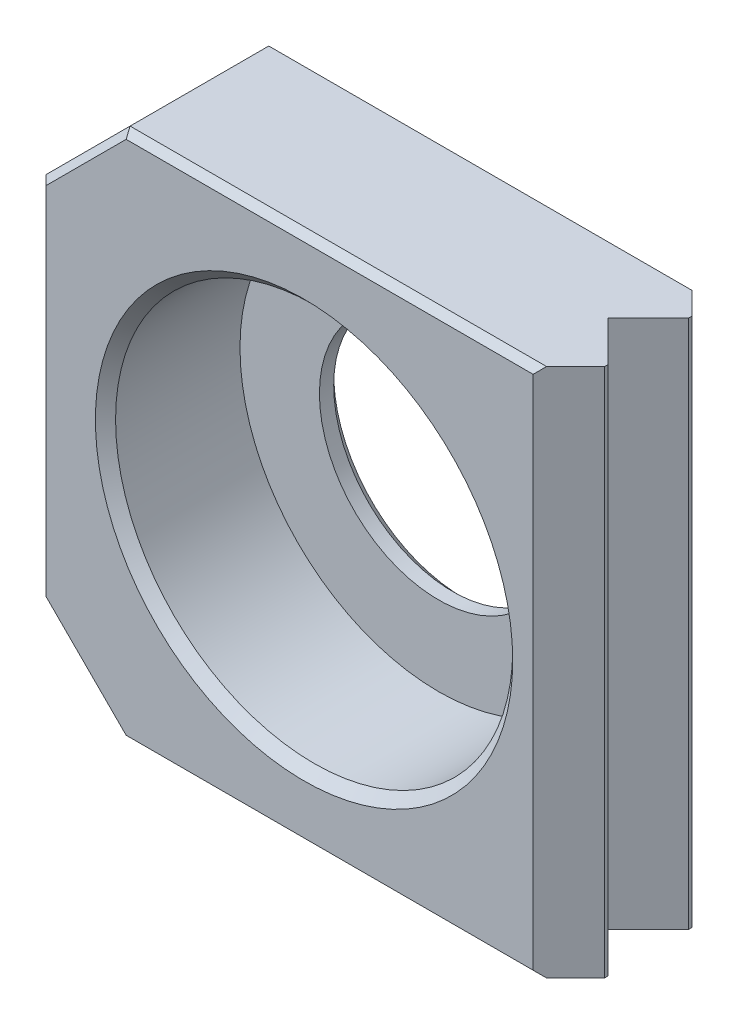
ISO-10303-21;
HEADER;
FILE_DESCRIPTION(('STEP AP214'),'2;1');
FILE_NAME('part.step','',(''),(''),'','','');
FILE_SCHEMA(('AUTOMOTIVE_DESIGN { 1 0 10303 214 1 1 1 1 }'));
ENDSEC;
DATA;
#1=APPLICATION_CONTEXT('core data for automotive mechanical design processes');
#2=APPLICATION_PROTOCOL_DEFINITION('international standard','automotive_design',2000,#1);
#3=PRODUCT_CONTEXT('',#1,'mechanical');
#4=PRODUCT('Part','Part','',(#3));
#5=PRODUCT_RELATED_PRODUCT_CATEGORY('part','',(#4));
#6=PRODUCT_DEFINITION_FORMATION('','',#4);
#7=PRODUCT_DEFINITION_CONTEXT('part definition',#1,'design');
#8=PRODUCT_DEFINITION('design','',#6,#7);
#9=PRODUCT_DEFINITION_SHAPE('','',#8);
#10=(LENGTH_UNIT() NAMED_UNIT(*) SI_UNIT(.MILLI.,.METRE.));
#11=(NAMED_UNIT(*) PLANE_ANGLE_UNIT() SI_UNIT($,.RADIAN.));
#12=(NAMED_UNIT(*) SI_UNIT($,.STERADIAN.) SOLID_ANGLE_UNIT());
#13=UNCERTAINTY_MEASURE_WITH_UNIT(LENGTH_MEASURE(1.E-05),#10,'distance_accuracy_value','');
#14=(GEOMETRIC_REPRESENTATION_CONTEXT(3) GLOBAL_UNCERTAINTY_ASSIGNED_CONTEXT((#13)) GLOBAL_UNIT_ASSIGNED_CONTEXT((#10,
#11,#12)) REPRESENTATION_CONTEXT('',''));
#15=CARTESIAN_POINT('',(0.,0.,0.));
#16=DIRECTION('',(0.,0.,1.));
#17=DIRECTION('',(1.,0.,0.));
#18=AXIS2_PLACEMENT_3D('',#15,#16,#17);
#19=CARTESIAN_POINT('',(10.,-10.,6.));
#20=DIRECTION('',(-1.,0.,0.));
#21=DIRECTION('',(0.,-1.,0.));
#22=AXIS2_PLACEMENT_3D('',#19,#20,#21);
#23=PLANE('',#22);
#24=DIRECTION('',(0.,-1.,0.));
#25=VECTOR('',#24,1.);
#26=CARTESIAN_POINT('',(10.,-10.,4.524));
#27=LINE('',#26,#25);
#28=CARTESIAN_POINT('',(10.,10.,4.524));
#29=VERTEX_POINT('',#28);
#30=CARTESIAN_POINT('',(10.,-10.,4.524));
#31=VERTEX_POINT('',#30);
#32=EDGE_CURVE('E176',#29,#31,#27,.T.);
#33=ORIENTED_EDGE('',*,*,#32,.F.);
#34=DIRECTION('',(0.,0.,-1.));
#35=VECTOR('',#34,1.);
#36=CARTESIAN_POINT('',(10.,10.,6.));
#37=LINE('',#36,#35);
#38=CARTESIAN_POINT('',(10.,10.,4.651));
#39=VERTEX_POINT('',#38);
#40=EDGE_CURVE('E159',#39,#29,#37,.T.);
#41=ORIENTED_EDGE('',*,*,#40,.F.);
#42=DIRECTION('',(0.,1.,0.));
#43=VECTOR('',#42,1.);
#44=CARTESIAN_POINT('',(10.,-10.,4.651));
#45=LINE('',#44,#43);
#46=CARTESIAN_POINT('',(10.,-10.,4.651));
#47=VERTEX_POINT('',#46);
#48=EDGE_CURVE('E173',#47,#39,#45,.T.);
#49=ORIENTED_EDGE('',*,*,#48,.F.);
#50=DIRECTION('',(0.,0.,-1.));
#51=VECTOR('',#50,1.);
#52=CARTESIAN_POINT('',(10.,-10.,6.));
#53=LINE('',#52,#51);
#54=EDGE_CURVE('E187',#47,#31,#53,.T.);
#55=ORIENTED_EDGE('',*,*,#54,.T.);
#56=EDGE_LOOP('',(#33,#41,#49,#55));
#57=FACE_BOUND('',#56,.T.);
#58=ADVANCED_FACE('F15',(#57),#23,.F.);
#59=CARTESIAN_POINT('',(-10.,10.,6.));
#60=DIRECTION('',(0.,1.,0.));
#61=DIRECTION('',(-1.,0.,0.));
#62=AXIS2_PLACEMENT_3D('',#59,#60,#61);
#63=PLANE('',#62);
#64=DIRECTION('',(0.,0.,1.));
#65=VECTOR('',#64,1.);
#66=CARTESIAN_POINT('',(-6.825,10.,6.));
#67=LINE('',#66,#65);
#68=CARTESIAN_POINT('',(-6.825,10.,0.508));
#69=VERTEX_POINT('',#68);
#70=CARTESIAN_POINT('',(-6.825,10.,5.746));
#71=VERTEX_POINT('',#70);
#72=EDGE_CURVE('E202',#69,#71,#67,.T.);
#73=ORIENTED_EDGE('',*,*,#72,.T.);
#74=DIRECTION('',(1.,0.,0.));
#75=VECTOR('',#74,1.);
#76=CARTESIAN_POINT('',(8.651,10.,5.746));
#77=LINE('',#76,#75);
#78=CARTESIAN_POINT('',(8.905,10.,5.746));
#79=VERTEX_POINT('',#78);
#80=EDGE_CURVE('E9',#71,#79,#77,.T.);
#81=ORIENTED_EDGE('',*,*,#80,.T.);
#82=DIRECTION('',(-0.707106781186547,0.,0.707106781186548));
#83=VECTOR('',#82,1.);
#84=CARTESIAN_POINT('',(10.0635,10.,4.5875));
#85=LINE('',#84,#83);
#86=EDGE_CURVE('E160',#39,#79,#85,.T.);
#87=ORIENTED_EDGE('',*,*,#86,.F.);
#88=ORIENTED_EDGE('',*,*,#40,.T.);
#89=DIRECTION('',(0.707106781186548,0.,0.707106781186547));
#90=VECTOR('',#89,1.);
#91=CARTESIAN_POINT('',(8.476,10.,3.));
#92=LINE('',#91,#90);
#93=CARTESIAN_POINT('',(8.476,10.,3.));
#94=VERTEX_POINT('',#93);
#95=EDGE_CURVE('E137',#94,#29,#92,.T.);
#96=ORIENTED_EDGE('',*,*,#95,.F.);
#97=DIRECTION('',(0.707106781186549,0.,-0.707106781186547));
#98=VECTOR('',#97,1.);
#99=CARTESIAN_POINT('',(8.476,10.,3.));
#100=LINE('',#99,#98);
#101=CARTESIAN_POINT('',(10.,10.,1.476));
#102=VERTEX_POINT('',#101);
#103=EDGE_CURVE('E144',#94,#102,#100,.T.);
#104=ORIENTED_EDGE('',*,*,#103,.T.);
#105=CARTESIAN_POINT('',(10.,10.,1.349));
#106=VERTEX_POINT('',#105);
#107=EDGE_CURVE('E188',#102,#106,#37,.T.);
#108=ORIENTED_EDGE('',*,*,#107,.T.);
#109=DIRECTION('',(-0.707106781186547,0.,-0.707106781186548));
#110=VECTOR('',#109,1.);
#111=CARTESIAN_POINT('',(10.0635,10.,1.4125));
#112=LINE('',#111,#110);
#113=CARTESIAN_POINT('',(9.159,10.,0.508));
#114=VERTEX_POINT('',#113);
#115=EDGE_CURVE('E153',#106,#114,#112,.T.);
#116=ORIENTED_EDGE('',*,*,#115,.T.);
#117=DIRECTION('',(-1.,0.,0.));
#118=VECTOR('',#117,1.);
#119=CARTESIAN_POINT('',(-10.,10.,0.508));
#120=LINE('',#119,#118);
#121=EDGE_CURVE('E241',#114,#69,#120,.T.);
#122=ORIENTED_EDGE('',*,*,#121,.T.);
#123=EDGE_LOOP('',(#73,#81,#87,#88,#96,#104,#108,#116,#122));
#124=FACE_BOUND('',#123,.T.);
#125=ADVANCED_FACE('F156',(#124),#63,.T.);
#126=CARTESIAN_POINT('',(10.,-10.,6.));
#127=DIRECTION('',(0.,-1.,0.));
#128=DIRECTION('',(1.,0.,0.));
#129=AXIS2_PLACEMENT_3D('',#126,#127,#128);
#130=PLANE('',#129);
#131=DIRECTION('',(-0.707106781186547,0.,0.707106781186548));
#132=VECTOR('',#131,1.);
#133=CARTESIAN_POINT('',(10.0635,-10.,4.5875));
#134=LINE('',#133,#132);
#135=CARTESIAN_POINT('',(8.905,-10.,5.746));
#136=VERTEX_POINT('',#135);
#137=EDGE_CURVE('E303',#47,#136,#134,.T.);
#138=ORIENTED_EDGE('',*,*,#137,.T.);
#139=DIRECTION('',(-1.,0.,0.));
#140=VECTOR('',#139,1.);
#141=CARTESIAN_POINT('',(-6.825,-10.,5.746));
#142=LINE('',#141,#140);
#143=CARTESIAN_POINT('',(-6.825,-10.,5.746));
#144=VERTEX_POINT('',#143);
#145=EDGE_CURVE('E243',#136,#144,#142,.T.);
#146=ORIENTED_EDGE('',*,*,#145,.T.);
#147=DIRECTION('',(0.,0.,-1.));
#148=VECTOR('',#147,1.);
#149=CARTESIAN_POINT('',(-6.825,-10.,0.));
#150=LINE('',#149,#148);
#151=CARTESIAN_POINT('',(-6.825,-10.,0.508));
#152=VERTEX_POINT('',#151);
#153=EDGE_CURVE('E196',#144,#152,#150,.T.);
#154=ORIENTED_EDGE('',*,*,#153,.T.);
#155=DIRECTION('',(1.,0.,0.));
#156=VECTOR('',#155,1.);
#157=CARTESIAN_POINT('',(10.,-10.,0.508));
#158=LINE('',#157,#156);
#159=CARTESIAN_POINT('',(9.159,-10.,0.508));
#160=VERTEX_POINT('',#159);
#161=EDGE_CURVE('E227',#152,#160,#158,.T.);
#162=ORIENTED_EDGE('',*,*,#161,.T.);
#163=DIRECTION('',(-0.707106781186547,0.,-0.707106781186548));
#164=VECTOR('',#163,1.);
#165=CARTESIAN_POINT('',(10.0635,-10.,1.4125));
#166=LINE('',#165,#164);
#167=CARTESIAN_POINT('',(10.,-10.,1.349));
#168=VERTEX_POINT('',#167);
#169=EDGE_CURVE('E165',#168,#160,#166,.T.);
#170=ORIENTED_EDGE('',*,*,#169,.F.);
#171=CARTESIAN_POINT('',(10.,-10.,1.476));
#172=VERTEX_POINT('',#171);
#173=EDGE_CURVE('E184',#172,#168,#53,.T.);
#174=ORIENTED_EDGE('',*,*,#173,.F.);
#175=DIRECTION('',(0.707106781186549,0.,-0.707106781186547));
#176=VECTOR('',#175,1.);
#177=CARTESIAN_POINT('',(8.476,-10.,3.));
#178=LINE('',#177,#176);
#179=CARTESIAN_POINT('',(8.476,-10.,3.));
#180=VERTEX_POINT('',#179);
#181=EDGE_CURVE('E161',#180,#172,#178,.T.);
#182=ORIENTED_EDGE('',*,*,#181,.F.);
#183=DIRECTION('',(0.707106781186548,0.,0.707106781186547));
#184=VECTOR('',#183,1.);
#185=CARTESIAN_POINT('',(8.476,-10.,3.));
#186=LINE('',#185,#184);
#187=EDGE_CURVE('E140',#180,#31,#186,.T.);
#188=ORIENTED_EDGE('',*,*,#187,.T.);
#189=ORIENTED_EDGE('',*,*,#54,.F.);
#190=EDGE_LOOP('',(#138,#146,#154,#162,#170,#174,#182,#188,#189));
#191=FACE_BOUND('',#190,.T.);
#192=ADVANCED_FACE('F355',(#191),#130,.T.);
#193=CARTESIAN_POINT('',(10.,10.,6.));
#194=DIRECTION('',(0.,0.,-1.));
#195=DIRECTION('',(1.,0.,0.));
#196=AXIS2_PLACEMENT_3D('',#193,#194,#195);
#197=PLANE('',#196);
#198=CARTESIAN_POINT('',(0.,0.,6.));
#199=DIRECTION('',(0.,0.,-1.));
#200=DIRECTION('',(1.,0.,0.));
#201=AXIS2_PLACEMENT_3D('',#198,#199,#200);
#202=CIRCLE('',#201,7.881);
#203=CARTESIAN_POINT('',(7.881,0.,6.));
#204=VERTEX_POINT('',#203);
#205=EDGE_CURVE('E207',#204,#204,#202,.T.);
#206=ORIENTED_EDGE('',*,*,#205,.T.);
#207=EDGE_LOOP('',(#206));
#208=FACE_BOUND('',#207,.T.);
#209=DIRECTION('',(0.707106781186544,-0.707106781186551,0.));
#210=VECTOR('',#209,1.);
#211=CARTESIAN_POINT('',(-6.64539487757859,-9.82039487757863,6.));
#212=LINE('',#211,#210);
#213=CARTESIAN_POINT('',(-9.746,-6.71978975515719,6.));
#214=VERTEX_POINT('',#213);
#215=CARTESIAN_POINT('',(-6.71978975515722,-9.746,6.));
#216=VERTEX_POINT('',#215);
#217=EDGE_CURVE('E252',#214,#216,#212,.T.);
#218=ORIENTED_EDGE('',*,*,#217,.T.);
#219=DIRECTION('',(1.,0.,0.));
#220=VECTOR('',#219,1.);
#221=CARTESIAN_POINT('',(8.651,-9.746,6.));
#222=LINE('',#221,#220);
#223=CARTESIAN_POINT('',(8.651,-9.746,6.));
#224=VERTEX_POINT('',#223);
#225=EDGE_CURVE('E254',#216,#224,#222,.T.);
#226=ORIENTED_EDGE('',*,*,#225,.T.);
#227=DIRECTION('',(0.,-1.,0.));
#228=VECTOR('',#227,1.);
#229=CARTESIAN_POINT('',(8.651,10.,6.));
#230=LINE('',#229,#228);
#231=CARTESIAN_POINT('',(8.651,9.746,6.));
#232=VERTEX_POINT('',#231);
#233=EDGE_CURVE('E193',#232,#224,#230,.T.);
#234=ORIENTED_EDGE('',*,*,#233,.F.);
#235=DIRECTION('',(-1.,0.,0.));
#236=VECTOR('',#235,1.);
#237=CARTESIAN_POINT('',(-6.825,9.746,6.));
#238=LINE('',#237,#236);
#239=CARTESIAN_POINT('',(-6.71978975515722,9.746,6.));
#240=VERTEX_POINT('',#239);
#241=EDGE_CURVE('E246',#232,#240,#238,.T.);
#242=ORIENTED_EDGE('',*,*,#241,.T.);
#243=DIRECTION('',(-0.707106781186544,-0.707106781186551,0.));
#244=VECTOR('',#243,1.);
#245=CARTESIAN_POINT('',(-9.82039487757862,6.64539487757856,6.));
#246=LINE('',#245,#244);
#247=CARTESIAN_POINT('',(-9.746,6.71978975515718,6.));
#248=VERTEX_POINT('',#247);
#249=EDGE_CURVE('E248',#240,#248,#246,.T.);
#250=ORIENTED_EDGE('',*,*,#249,.T.);
#251=DIRECTION('',(0.,-1.,0.));
#252=VECTOR('',#251,1.);
#253=CARTESIAN_POINT('',(-9.746,10.,6.));
#254=LINE('',#253,#252);
#255=EDGE_CURVE('E250',#248,#214,#254,.T.);
#256=ORIENTED_EDGE('',*,*,#255,.T.);
#257=EDGE_LOOP('',(#218,#226,#234,#242,#250,#256));
#258=FACE_BOUND('',#257,.T.);
#259=ADVANCED_FACE('F357',(#208,#258),#197,.F.);
#260=ORIENTED_EDGE('',*,*,#173,.T.);
#261=DIRECTION('',(0.,1.,0.));
#262=VECTOR('',#261,1.);
#263=CARTESIAN_POINT('',(10.,-10.,1.349));
#264=LINE('',#263,#262);
#265=EDGE_CURVE('E143',#168,#106,#264,.T.);
#266=ORIENTED_EDGE('',*,*,#265,.T.);
#267=ORIENTED_EDGE('',*,*,#107,.F.);
#268=DIRECTION('',(0.,-1.,0.));
#269=VECTOR('',#268,1.);
#270=CARTESIAN_POINT('',(10.,-10.,1.476));
#271=LINE('',#270,#269);
#272=EDGE_CURVE('E149',#102,#172,#271,.T.);
#273=ORIENTED_EDGE('',*,*,#272,.T.);
#274=EDGE_LOOP('',(#260,#266,#267,#273));
#275=FACE_BOUND('',#274,.T.);
#276=ADVANCED_FACE('F17',(#275),#23,.F.);
#277=CARTESIAN_POINT('',(-10.,10.,6.));
#278=DIRECTION('',(1.,0.,0.));
#279=DIRECTION('',(0.,0.,1.));
#280=AXIS2_PLACEMENT_3D('',#277,#278,#279);
#281=PLANE('',#280);
#282=DIRECTION('',(0.,0.,1.));
#283=VECTOR('',#282,1.);
#284=CARTESIAN_POINT('',(-10.,-6.825,6.));
#285=LINE('',#284,#283);
#286=CARTESIAN_POINT('',(-10.,-6.825,0.508));
#287=VERTEX_POINT('',#286);
#288=CARTESIAN_POINT('',(-10.,-6.825,5.746));
#289=VERTEX_POINT('',#288);
#290=EDGE_CURVE('E200',#287,#289,#285,.T.);
#291=ORIENTED_EDGE('',*,*,#290,.T.);
#292=DIRECTION('',(0.,1.,0.));
#293=VECTOR('',#292,1.);
#294=CARTESIAN_POINT('',(-10.,10.,5.746));
#295=LINE('',#294,#293);
#296=CARTESIAN_POINT('',(-10.,6.825,5.746));
#297=VERTEX_POINT('',#296);
#298=EDGE_CURVE('E37',#289,#297,#295,.T.);
#299=ORIENTED_EDGE('',*,*,#298,.T.);
#300=DIRECTION('',(0.,0.,-1.));
#301=VECTOR('',#300,1.);
#302=CARTESIAN_POINT('',(-10.,6.825,0.));
#303=LINE('',#302,#301);
#304=CARTESIAN_POINT('',(-10.,6.825,0.508));
#305=VERTEX_POINT('',#304);
#306=EDGE_CURVE('E198',#297,#305,#303,.T.);
#307=ORIENTED_EDGE('',*,*,#306,.T.);
#308=DIRECTION('',(0.,-1.,0.));
#309=VECTOR('',#308,1.);
#310=CARTESIAN_POINT('',(-10.,-6.825,0.508));
#311=LINE('',#310,#309);
#312=EDGE_CURVE('E236',#305,#287,#311,.T.);
#313=ORIENTED_EDGE('',*,*,#312,.T.);
#314=EDGE_LOOP('',(#291,#299,#307,#313));
#315=FACE_BOUND('',#314,.T.);
#316=ADVANCED_FACE('F271',(#315),#281,.F.);
#317=CARTESIAN_POINT('',(10.,10.,0.));
#318=DIRECTION('',(0.,0.,-1.));
#319=DIRECTION('',(1.,0.,0.));
#320=AXIS2_PLACEMENT_3D('',#317,#318,#319);
#321=PLANE('',#320);
#322=CARTESIAN_POINT('',(0.,0.,0.));
#323=DIRECTION('',(0.,0.,-1.));
#324=DIRECTION('',(1.,0.,0.));
#325=AXIS2_PLACEMENT_3D('',#322,#323,#324);
#326=CIRCLE('',#325,4.881);
#327=CARTESIAN_POINT('',(4.881,0.,0.));
#328=VERTEX_POINT('',#327);
#329=EDGE_CURVE('E210',#328,#328,#326,.F.);
#330=ORIENTED_EDGE('',*,*,#329,.T.);
#331=EDGE_LOOP('',(#330));
#332=FACE_BOUND('',#331,.T.);
#333=DIRECTION('',(0.,1.,0.));
#334=VECTOR('',#333,1.);
#335=CARTESIAN_POINT('',(8.651,10.,0.));
#336=LINE('',#335,#334);
#337=CARTESIAN_POINT('',(8.651,-9.492,0.));
#338=VERTEX_POINT('',#337);
#339=CARTESIAN_POINT('',(8.651,9.492,0.));
#340=VERTEX_POINT('',#339);
#341=EDGE_CURVE('E190',#338,#340,#336,.T.);
#342=ORIENTED_EDGE('',*,*,#341,.F.);
#343=DIRECTION('',(-1.,0.,0.));
#344=VECTOR('',#343,1.);
#345=CARTESIAN_POINT('',(10.,-9.492,0.));
#346=LINE('',#345,#344);
#347=CARTESIAN_POINT('',(-6.61457951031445,-9.492,0.));
#348=VERTEX_POINT('',#347);
#349=EDGE_CURVE('E224',#338,#348,#346,.T.);
#350=ORIENTED_EDGE('',*,*,#349,.T.);
#351=DIRECTION('',(-0.707106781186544,0.707106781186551,0.));
#352=VECTOR('',#351,1.);
#353=CARTESIAN_POINT('',(-8.05328975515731,-8.05328975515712,0.));
#354=LINE('',#353,#352);
#355=CARTESIAN_POINT('',(-9.492,-6.61457951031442,0.));
#356=VERTEX_POINT('',#355);
#357=EDGE_CURVE('E222',#348,#356,#354,.T.);
#358=ORIENTED_EDGE('',*,*,#357,.T.);
#359=DIRECTION('',(0.,1.,0.));
#360=VECTOR('',#359,1.);
#361=CARTESIAN_POINT('',(-9.492,6.825,0.));
#362=LINE('',#361,#360);
#363=CARTESIAN_POINT('',(-9.492,6.61457951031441,0.));
#364=VERTEX_POINT('',#363);
#365=EDGE_CURVE('E220',#356,#364,#362,.T.);
#366=ORIENTED_EDGE('',*,*,#365,.T.);
#367=DIRECTION('',(0.707106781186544,0.707106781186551,0.));
#368=VECTOR('',#367,1.);
#369=CARTESIAN_POINT('',(1.9467102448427,18.0532897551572,0.));
#370=LINE('',#369,#368);
#371=CARTESIAN_POINT('',(-6.61457951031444,9.492,0.));
#372=VERTEX_POINT('',#371);
#373=EDGE_CURVE('E218',#364,#372,#370,.T.);
#374=ORIENTED_EDGE('',*,*,#373,.T.);
#375=DIRECTION('',(1.,0.,0.));
#376=VECTOR('',#375,1.);
#377=CARTESIAN_POINT('',(10.,9.492,0.));
#378=LINE('',#377,#376);
#379=EDGE_CURVE('E216',#372,#340,#378,.T.);
#380=ORIENTED_EDGE('',*,*,#379,.T.);
#381=EDGE_LOOP('',(#342,#350,#358,#366,#374,#380));
#382=FACE_BOUND('',#381,.T.);
#383=ADVANCED_FACE('F320',(#332,#382),#321,.T.);
#384=CARTESIAN_POINT('',(0.,0.,0.92));
#385=DIRECTION('',(0.,0.,1.));
#386=DIRECTION('',(-1.,0.,0.));
#387=AXIS2_PLACEMENT_3D('',#384,#385,#386);
#388=CYLINDRICAL_SURFACE('',#387,7.5);
#389=CARTESIAN_POINT('',(0.,0.,5.619));
#390=DIRECTION('',(0.,0.,-1.));
#391=DIRECTION('',(1.,0.,0.));
#392=AXIS2_PLACEMENT_3D('',#389,#390,#391);
#393=CIRCLE('',#392,7.5);
#394=CARTESIAN_POINT('',(7.5,0.,5.619));
#395=VERTEX_POINT('',#394);
#396=EDGE_CURVE('E204',#395,#395,#393,.F.);
#397=ORIENTED_EDGE('',*,*,#396,.T.);
#398=EDGE_LOOP('',(#397));
#399=FACE_BOUND('',#398,.T.);
#400=CARTESIAN_POINT('',(0.,0.,0.92));
#401=DIRECTION('',(0.,0.,1.));
#402=DIRECTION('',(-1.,0.,0.));
#403=AXIS2_PLACEMENT_3D('',#400,#401,#402);
#404=CIRCLE('',#403,7.5);
#405=CARTESIAN_POINT('',(-7.5,0.,0.92));
#406=VERTEX_POINT('',#405);
#407=EDGE_CURVE('E181',#406,#406,#404,.T.);
#408=ORIENTED_EDGE('',*,*,#407,.F.);
#409=EDGE_LOOP('',(#408));
#410=FACE_BOUND('',#409,.T.);
#411=ADVANCED_FACE('F571',(#399,#410),#388,.F.);
#412=CARTESIAN_POINT('',(0.,0.,0.92));
#413=DIRECTION('',(0.,0.,1.));
#414=DIRECTION('',(-1.,0.,0.));
#415=AXIS2_PLACEMENT_3D('',#412,#413,#414);
#416=PLANE('',#415);
#417=CARTESIAN_POINT('',(0.,0.,0.92));
#418=DIRECTION('',(0.,0.,1.));
#419=DIRECTION('',(-1.,0.,0.));
#420=AXIS2_PLACEMENT_3D('',#417,#418,#419);
#421=CIRCLE('',#420,4.5);
#422=CARTESIAN_POINT('',(-4.5,0.,0.92));
#423=VERTEX_POINT('',#422);
#424=EDGE_CURVE('E178',#423,#423,#421,.T.);
#425=ORIENTED_EDGE('',*,*,#424,.F.);
#426=EDGE_LOOP('',(#425));
#427=FACE_BOUND('',#426,.T.);
#428=ORIENTED_EDGE('',*,*,#407,.T.);
#429=EDGE_LOOP('',(#428));
#430=FACE_BOUND('',#429,.T.);
#431=ADVANCED_FACE('F561',(#427,#430),#416,.T.);
#432=CARTESIAN_POINT('',(0.,0.,0.));
#433=DIRECTION('',(0.,0.,1.));
#434=DIRECTION('',(-1.,0.,0.));
#435=AXIS2_PLACEMENT_3D('',#432,#433,#434);
#436=CYLINDRICAL_SURFACE('',#435,4.5);
#437=CARTESIAN_POINT('',(0.,0.,0.381));
#438=DIRECTION('',(0.,0.,-1.));
#439=DIRECTION('',(1.,0.,0.));
#440=AXIS2_PLACEMENT_3D('',#437,#438,#439);
#441=CIRCLE('',#440,4.5);
#442=CARTESIAN_POINT('',(4.5,0.,0.381));
#443=VERTEX_POINT('',#442);
#444=EDGE_CURVE('E213',#443,#443,#441,.T.);
#445=ORIENTED_EDGE('',*,*,#444,.T.);
#446=EDGE_LOOP('',(#445));
#447=FACE_BOUND('',#446,.T.);
#448=ORIENTED_EDGE('',*,*,#424,.T.);
#449=EDGE_LOOP('',(#448));
#450=FACE_BOUND('',#449,.T.);
#451=ADVANCED_FACE('F552',(#447,#450),#436,.F.);
#452=CARTESIAN_POINT('',(10.0635,10.,1.4125));
#453=DIRECTION('',(-0.707106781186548,0.,0.707106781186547));
#454=DIRECTION('',(-0.707106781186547,0.,-0.707106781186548));
#455=AXIS2_PLACEMENT_3D('',#452,#453,#454);
#456=PLANE('',#455);
#457=ORIENTED_EDGE('',*,*,#169,.T.);
#458=DIRECTION('',(0.577350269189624,-0.577350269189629,0.577350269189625));
#459=VECTOR('',#458,1.);
#460=CARTESIAN_POINT('',(9.10066666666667,-9.94166666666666,0.449666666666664));
#461=LINE('',#460,#459);
#462=EDGE_CURVE('E231',#160,#338,#461,.F.);
#463=ORIENTED_EDGE('',*,*,#462,.T.);
#464=ORIENTED_EDGE('',*,*,#341,.T.);
#465=DIRECTION('',(-0.577350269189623,-0.57735026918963,-0.577350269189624));
#466=VECTOR('',#465,1.);
#467=CARTESIAN_POINT('',(9.10066666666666,9.94166666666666,0.449666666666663));
#468=LINE('',#467,#466);
#469=EDGE_CURVE('E229',#340,#114,#468,.F.);
#470=ORIENTED_EDGE('',*,*,#469,.T.);
#471=ORIENTED_EDGE('',*,*,#115,.F.);
#472=ORIENTED_EDGE('',*,*,#265,.F.);
#473=EDGE_LOOP('',(#457,#463,#464,#470,#471,#472));
#474=FACE_BOUND('',#473,.T.);
#475=ADVANCED_FACE('F309',(#474),#456,.F.);
#476=CARTESIAN_POINT('',(10.0635,10.,4.5875));
#477=DIRECTION('',(0.707106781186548,0.,0.707106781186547));
#478=DIRECTION('',(-0.707106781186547,0.,0.707106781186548));
#479=AXIS2_PLACEMENT_3D('',#476,#477,#478);
#480=PLANE('',#479);
#481=ORIENTED_EDGE('',*,*,#233,.T.);
#482=DIRECTION('',(0.577350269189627,-0.577350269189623,-0.577350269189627));
#483=VECTOR('',#482,1.);
#484=CARTESIAN_POINT('',(3.01066666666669,-4.10566666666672,11.6403333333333));
#485=LINE('',#484,#483);
#486=EDGE_CURVE('E258',#224,#136,#485,.T.);
#487=ORIENTED_EDGE('',*,*,#486,.T.);
#488=ORIENTED_EDGE('',*,*,#137,.F.);
#489=ORIENTED_EDGE('',*,*,#48,.T.);
#490=ORIENTED_EDGE('',*,*,#86,.T.);
#491=DIRECTION('',(-0.577350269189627,-0.577350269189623,0.577350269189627));
#492=VECTOR('',#491,1.);
#493=CARTESIAN_POINT('',(9.67733333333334,10.7723333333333,4.97366666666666));
#494=LINE('',#493,#492);
#495=EDGE_CURVE('E256',#79,#232,#494,.T.);
#496=ORIENTED_EDGE('',*,*,#495,.T.);
#497=EDGE_LOOP('',(#481,#487,#488,#489,#490,#496));
#498=FACE_BOUND('',#497,.T.);
#499=ADVANCED_FACE('F370',(#498),#480,.T.);
#500=CARTESIAN_POINT('',(8.476,10.,3.));
#501=DIRECTION('',(0.707106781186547,0.,-0.707106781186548));
#502=DIRECTION('',(0.707106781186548,0.,0.707106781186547));
#503=AXIS2_PLACEMENT_3D('',#500,#501,#502);
#504=PLANE('',#503);
#505=ORIENTED_EDGE('',*,*,#32,.T.);
#506=ORIENTED_EDGE('',*,*,#187,.F.);
#507=DIRECTION('',(0.,-1.,0.));
#508=VECTOR('',#507,1.);
#509=CARTESIAN_POINT('',(8.476,10.,3.));
#510=LINE('',#509,#508);
#511=EDGE_CURVE('E133',#94,#180,#510,.T.);
#512=ORIENTED_EDGE('',*,*,#511,.F.);
#513=ORIENTED_EDGE('',*,*,#95,.T.);
#514=EDGE_LOOP('',(#505,#506,#512,#513));
#515=FACE_BOUND('',#514,.T.);
#516=ADVANCED_FACE('F135',(#515),#504,.T.);
#517=CARTESIAN_POINT('',(8.476,10.,3.));
#518=DIRECTION('',(-0.707106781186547,0.,-0.707106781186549));
#519=DIRECTION('',(0.707106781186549,0.,-0.707106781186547));
#520=AXIS2_PLACEMENT_3D('',#517,#518,#519);
#521=PLANE('',#520);
#522=ORIENTED_EDGE('',*,*,#103,.F.);
#523=ORIENTED_EDGE('',*,*,#511,.T.);
#524=ORIENTED_EDGE('',*,*,#181,.T.);
#525=ORIENTED_EDGE('',*,*,#272,.F.);
#526=EDGE_LOOP('',(#522,#523,#524,#525));
#527=FACE_BOUND('',#526,.T.);
#528=ADVANCED_FACE('F147',(#527),#521,.F.);
#529=CARTESIAN_POINT('',(-6.825,-10.,6.));
#530=DIRECTION('',(-0.707106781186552,-0.707106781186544,0.));
#531=DIRECTION('',(0.707106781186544,-0.707106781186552,0.));
#532=AXIS2_PLACEMENT_3D('',#529,#530,#531);
#533=PLANE('',#532);
#534=ORIENTED_EDGE('',*,*,#153,.F.);
#535=DIRECTION('',(-0.707106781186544,0.707106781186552,0.));
#536=VECTOR('',#535,1.);
#537=CARTESIAN_POINT('',(-10.,-6.825,5.746));
#538=LINE('',#537,#536);
#539=EDGE_CURVE('E260',#144,#289,#538,.T.);
#540=ORIENTED_EDGE('',*,*,#539,.T.);
#541=ORIENTED_EDGE('',*,*,#290,.F.);
#542=DIRECTION('',(0.707106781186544,-0.707106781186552,0.));
#543=VECTOR('',#542,1.);
#544=CARTESIAN_POINT('',(-6.825,-10.,0.508));
#545=LINE('',#544,#543);
#546=EDGE_CURVE('E233',#287,#152,#545,.T.);
#547=ORIENTED_EDGE('',*,*,#546,.T.);
#548=EDGE_LOOP('',(#534,#540,#541,#547));
#549=FACE_BOUND('',#548,.T.);
#550=ADVANCED_FACE('F266',(#549),#533,.T.);
#551=CARTESIAN_POINT('',(-10.,6.825,6.));
#552=DIRECTION('',(-0.707106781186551,0.707106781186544,0.));
#553=DIRECTION('',(-0.707106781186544,-0.707106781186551,0.));
#554=AXIS2_PLACEMENT_3D('',#551,#552,#553);
#555=PLANE('',#554);
#556=ORIENTED_EDGE('',*,*,#306,.F.);
#557=DIRECTION('',(0.707106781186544,0.707106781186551,0.));
#558=VECTOR('',#557,1.);
#559=CARTESIAN_POINT('',(-6.825,10.,5.746));
#560=LINE('',#559,#558);
#561=EDGE_CURVE('E23',#297,#71,#560,.T.);
#562=ORIENTED_EDGE('',*,*,#561,.T.);
#563=ORIENTED_EDGE('',*,*,#72,.F.);
#564=DIRECTION('',(-0.707106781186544,-0.707106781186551,0.));
#565=VECTOR('',#564,1.);
#566=CARTESIAN_POINT('',(-10.,6.825,0.508));
#567=LINE('',#566,#565);
#568=EDGE_CURVE('E238',#69,#305,#567,.T.);
#569=ORIENTED_EDGE('',*,*,#568,.T.);
#570=EDGE_LOOP('',(#556,#562,#563,#569));
#571=FACE_BOUND('',#570,.T.);
#572=ADVANCED_FACE('F330',(#571),#555,.T.);
#573=CARTESIAN_POINT('',(0.,0.,5.619));
#574=DIRECTION('',(0.,0.,1.));
#575=DIRECTION('',(-1.,0.,0.));
#576=AXIS2_PLACEMENT_3D('',#573,#574,#575);
#577=CONICAL_SURFACE('',#576,7.5,0.785398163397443);
#578=ORIENTED_EDGE('',*,*,#205,.F.);
#579=EDGE_LOOP('',(#578));
#580=FACE_BOUND('',#579,.T.);
#581=ORIENTED_EDGE('',*,*,#396,.F.);
#582=EDGE_LOOP('',(#581));
#583=FACE_BOUND('',#582,.T.);
#584=ADVANCED_FACE('F493',(#580,#583),#577,.F.);
#585=CARTESIAN_POINT('',(0.,0.,0.));
#586=DIRECTION('',(0.,0.,-1.));
#587=DIRECTION('',(1.,0.,0.));
#588=AXIS2_PLACEMENT_3D('',#585,#586,#587);
#589=CONICAL_SURFACE('',#588,4.881,0.785398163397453);
#590=ORIENTED_EDGE('',*,*,#444,.F.);
#591=EDGE_LOOP('',(#590));
#592=FACE_BOUND('',#591,.T.);
#593=ORIENTED_EDGE('',*,*,#329,.F.);
#594=EDGE_LOOP('',(#593));
#595=FACE_BOUND('',#594,.T.);
#596=ADVANCED_FACE('F484',(#592,#595),#589,.F.);
#597=CARTESIAN_POINT('',(10.,9.492,0.));
#598=DIRECTION('',(0.,-0.707106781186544,0.707106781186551));
#599=DIRECTION('',(0.,-0.707106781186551,-0.707106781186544));
#600=AXIS2_PLACEMENT_3D('',#597,#598,#599);
#601=PLANE('',#600);
#602=ORIENTED_EDGE('',*,*,#469,.F.);
#603=ORIENTED_EDGE('',*,*,#379,.F.);
#604=DIRECTION('',(-0.281084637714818,0.678598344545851,0.678598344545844));
#605=VECTOR('',#604,1.);
#606=CARTESIAN_POINT('',(-5.30188528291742,6.32287579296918,-3.16912420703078));
#607=LINE('',#606,#605);
#608=EDGE_CURVE('E299',#69,#372,#607,.F.);
#609=ORIENTED_EDGE('',*,*,#608,.F.);
#610=ORIENTED_EDGE('',*,*,#121,.F.);
#611=EDGE_LOOP('',(#602,#603,#609,#610));
#612=FACE_BOUND('',#611,.T.);
#613=ADVANCED_FACE('F326',(#612),#601,.F.);
#614=CARTESIAN_POINT('',(1.9467102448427,18.0532897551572,0.));
#615=DIRECTION('',(0.5,-0.5,0.707106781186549));
#616=DIRECTION('',(-0.816496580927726,0.,0.577350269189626));
#617=AXIS2_PLACEMENT_3D('',#614,#615,#616);
#618=PLANE('',#617);
#619=ORIENTED_EDGE('',*,*,#608,.T.);
#620=ORIENTED_EDGE('',*,*,#373,.F.);
#621=DIRECTION('',(0.678598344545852,-0.281084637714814,-0.678598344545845));
#622=VECTOR('',#621,1.);
#623=CARTESIAN_POINT('',(-6.40638339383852,5.33647526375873,-3.08561660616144));
#624=LINE('',#623,#622);
#625=EDGE_CURVE('E296',#305,#364,#624,.T.);
#626=ORIENTED_EDGE('',*,*,#625,.F.);
#627=ORIENTED_EDGE('',*,*,#568,.F.);
#628=EDGE_LOOP('',(#619,#620,#626,#627));
#629=FACE_BOUND('',#628,.T.);
#630=ADVANCED_FACE('F334',(#629),#618,.F.);
#631=CARTESIAN_POINT('',(-10.,10.,0.508));
#632=DIRECTION('',(-0.707106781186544,0.,-0.707106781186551));
#633=DIRECTION('',(0.707106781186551,0.,-0.707106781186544));
#634=AXIS2_PLACEMENT_3D('',#631,#632,#633);
#635=PLANE('',#634);
#636=ORIENTED_EDGE('',*,*,#625,.T.);
#637=ORIENTED_EDGE('',*,*,#365,.F.);
#638=DIRECTION('',(0.678598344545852,0.281084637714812,-0.678598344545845));
#639=VECTOR('',#638,1.);
#640=CARTESIAN_POINT('',(-6.79073943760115,-5.49568074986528,-2.70126056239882));
#641=LINE('',#640,#639);
#642=EDGE_CURVE('E293',#287,#356,#641,.T.);
#643=ORIENTED_EDGE('',*,*,#642,.F.);
#644=ORIENTED_EDGE('',*,*,#312,.F.);
#645=EDGE_LOOP('',(#636,#637,#643,#644));
#646=FACE_BOUND('',#645,.T.);
#647=ADVANCED_FACE('F336',(#646),#635,.T.);
#648=CARTESIAN_POINT('',(-8.05328975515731,-8.05328975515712,0.));
#649=DIRECTION('',(0.5,0.5,0.707106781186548));
#650=DIRECTION('',(-0.816496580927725,0.,0.577350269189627));
#651=AXIS2_PLACEMENT_3D('',#648,#649,#650);
#652=PLANE('',#651);
#653=ORIENTED_EDGE('',*,*,#642,.T.);
#654=ORIENTED_EDGE('',*,*,#357,.F.);
#655=DIRECTION('',(-0.281084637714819,-0.67859834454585,0.678598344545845));
#656=VECTOR('',#655,1.);
#657=CARTESIAN_POINT('',(-6.45382522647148,-9.10390482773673,-0.388095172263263));
#658=LINE('',#657,#656);
#659=EDGE_CURVE('E291',#152,#348,#658,.F.);
#660=ORIENTED_EDGE('',*,*,#659,.F.);
#661=ORIENTED_EDGE('',*,*,#546,.F.);
#662=EDGE_LOOP('',(#653,#654,#660,#661));
#663=FACE_BOUND('',#662,.T.);
#664=ADVANCED_FACE('F339',(#663),#652,.F.);
#665=CARTESIAN_POINT('',(10.,-9.492,0.));
#666=DIRECTION('',(0.,0.707106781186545,0.70710678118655));
#667=DIRECTION('',(0.,-0.70710678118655,0.707106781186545));
#668=AXIS2_PLACEMENT_3D('',#665,#666,#667);
#669=PLANE('',#668);
#670=ORIENTED_EDGE('',*,*,#462,.F.);
#671=ORIENTED_EDGE('',*,*,#161,.F.);
#672=ORIENTED_EDGE('',*,*,#659,.T.);
#673=ORIENTED_EDGE('',*,*,#349,.F.);
#674=EDGE_LOOP('',(#670,#671,#672,#673));
#675=FACE_BOUND('',#674,.T.);
#676=ADVANCED_FACE('F316',(#675),#669,.F.);
#677=CARTESIAN_POINT('',(-10.,10.,5.746));
#678=DIRECTION('',(0.,0.70710678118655,0.707106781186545));
#679=DIRECTION('',(0.,-0.707106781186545,0.70710678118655));
#680=AXIS2_PLACEMENT_3D('',#677,#678,#679);
#681=PLANE('',#680);
#682=ORIENTED_EDGE('',*,*,#495,.F.);
#683=ORIENTED_EDGE('',*,*,#80,.F.);
#684=DIRECTION('',(0.28108463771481,-0.678598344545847,0.678598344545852));
#685=VECTOR('',#684,1.);
#686=CARTESIAN_POINT('',(-7.07585222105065,10.605610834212,5.14038916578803));
#687=LINE('',#686,#685);
#688=EDGE_CURVE('E285',#240,#71,#687,.F.);
#689=ORIENTED_EDGE('',*,*,#688,.F.);
#690=ORIENTED_EDGE('',*,*,#241,.F.);
#691=EDGE_LOOP('',(#682,#683,#689,#690));
#692=FACE_BOUND('',#691,.T.);
#693=ADVANCED_FACE('F347',(#692),#681,.T.);
#694=CARTESIAN_POINT('',(1.76710512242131,18.2328948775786,6.));
#695=DIRECTION('',(-0.500000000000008,0.5,0.70710678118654));
#696=DIRECTION('',(-0.816496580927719,0.,-0.577350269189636));
#697=AXIS2_PLACEMENT_3D('',#694,#695,#696);
#698=PLANE('',#697);
#699=ORIENTED_EDGE('',*,*,#688,.T.);
#700=ORIENTED_EDGE('',*,*,#561,.F.);
#701=DIRECTION('',(-0.678598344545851,0.2810846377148,-0.678598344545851));
#702=VECTOR('',#701,1.);
#703=CARTESIAN_POINT('',(-6.64031521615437,5.43337299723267,9.10568478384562));
#704=LINE('',#703,#702);
#705=EDGE_CURVE('E281',#248,#297,#704,.T.);
#706=ORIENTED_EDGE('',*,*,#705,.F.);
#707=ORIENTED_EDGE('',*,*,#249,.F.);
#708=EDGE_LOOP('',(#699,#700,#706,#707));
#709=FACE_BOUND('',#708,.T.);
#710=ADVANCED_FACE('F377',(#709),#698,.T.);
#711=CARTESIAN_POINT('',(-9.746,10.,6.));
#712=DIRECTION('',(0.707106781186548,0.,-0.707106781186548));
#713=DIRECTION('',(0.707106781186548,0.,0.707106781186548));
#714=AXIS2_PLACEMENT_3D('',#711,#712,#713);
#715=PLANE('',#714);
#716=ORIENTED_EDGE('',*,*,#705,.T.);
#717=ORIENTED_EDGE('',*,*,#298,.F.);
#718=DIRECTION('',(-0.678598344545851,-0.2810846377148,-0.678598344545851));
#719=VECTOR('',#718,1.);
#720=CARTESIAN_POINT('',(-6.55680761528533,-5.39878301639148,9.18919238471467));
#721=LINE('',#720,#719);
#722=EDGE_CURVE('E278',#214,#289,#721,.T.);
#723=ORIENTED_EDGE('',*,*,#722,.F.);
#724=ORIENTED_EDGE('',*,*,#255,.F.);
#725=EDGE_LOOP('',(#716,#717,#723,#724));
#726=FACE_BOUND('',#725,.T.);
#727=ADVANCED_FACE('F276',(#726),#715,.F.);
#728=CARTESIAN_POINT('',(-8.2328948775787,-8.2328948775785,6.));
#729=DIRECTION('',(-0.500000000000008,-0.5,0.70710678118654));
#730=DIRECTION('',(-0.816496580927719,0.,-0.577350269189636));
#731=AXIS2_PLACEMENT_3D('',#728,#729,#730);
#732=PLANE('',#731);
#733=ORIENTED_EDGE('',*,*,#722,.T.);
#734=ORIENTED_EDGE('',*,*,#539,.F.);
#735=DIRECTION('',(0.281084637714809,0.678598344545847,0.678598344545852));
#736=VECTOR('',#735,1.);
#737=CARTESIAN_POINT('',(-6.55072295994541,-9.33783665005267,6.40816334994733));
#738=LINE('',#737,#736);
#739=EDGE_CURVE('E283',#216,#144,#738,.F.);
#740=ORIENTED_EDGE('',*,*,#739,.F.);
#741=ORIENTED_EDGE('',*,*,#217,.F.);
#742=EDGE_LOOP('',(#733,#734,#740,#741));
#743=FACE_BOUND('',#742,.T.);
#744=ADVANCED_FACE('F282',(#743),#732,.T.);
#745=CARTESIAN_POINT('',(10.,-10.,5.746));
#746=DIRECTION('',(0.,-0.70710678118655,0.707106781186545));
#747=DIRECTION('',(0.,-0.707106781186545,-0.70710678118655));
#748=AXIS2_PLACEMENT_3D('',#745,#746,#747);
#749=PLANE('',#748);
#750=ORIENTED_EDGE('',*,*,#486,.F.);
#751=ORIENTED_EDGE('',*,*,#225,.F.);
#752=ORIENTED_EDGE('',*,*,#739,.T.);
#753=ORIENTED_EDGE('',*,*,#145,.F.);
#754=EDGE_LOOP('',(#750,#751,#752,#753));
#755=FACE_BOUND('',#754,.T.);
#756=ADVANCED_FACE('F384',(#755),#749,.T.);
#757=CLOSED_SHELL('',(#58,#125,#192,#259,#276,#316,#383,#411,#431,#451,#475,#499,#516,#528,#550,
#572,#584,#596,#613,#630,#647,#664,#676,#693,#710,#727,#744,#756));
#758=MANIFOLD_SOLID_BREP('B1',#757);
#759=ADVANCED_BREP_SHAPE_REPRESENTATION('',(#18,#758),#14);
#760=SHAPE_DEFINITION_REPRESENTATION(#9,#759);
ENDSEC;
END-ISO-10303-21;
